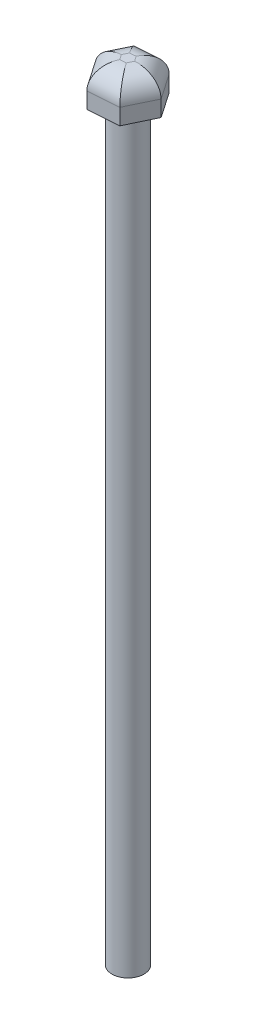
ISO-10303-21;
HEADER;
FILE_DESCRIPTION(('STEP AP214'),'2;1');
FILE_NAME('part.step','',(''),(''),'','','');
FILE_SCHEMA(('AUTOMOTIVE_DESIGN { 1 0 10303 214 1 1 1 1 }'));
ENDSEC;
DATA;
#1=APPLICATION_CONTEXT('core data for automotive mechanical design processes');
#2=APPLICATION_PROTOCOL_DEFINITION('international standard','automotive_design',2000,#1);
#3=PRODUCT_CONTEXT('',#1,'mechanical');
#4=PRODUCT('Part','Part','',(#3));
#5=PRODUCT_RELATED_PRODUCT_CATEGORY('part','',(#4));
#6=PRODUCT_DEFINITION_FORMATION('','',#4);
#7=PRODUCT_DEFINITION_CONTEXT('part definition',#1,'design');
#8=PRODUCT_DEFINITION('design','',#6,#7);
#9=PRODUCT_DEFINITION_SHAPE('','',#8);
#10=(LENGTH_UNIT() NAMED_UNIT(*) SI_UNIT(.MILLI.,.METRE.));
#11=(NAMED_UNIT(*) PLANE_ANGLE_UNIT() SI_UNIT($,.RADIAN.));
#12=(NAMED_UNIT(*) SI_UNIT($,.STERADIAN.) SOLID_ANGLE_UNIT());
#13=UNCERTAINTY_MEASURE_WITH_UNIT(LENGTH_MEASURE(1.E-05),#10,'distance_accuracy_value','');
#14=(GEOMETRIC_REPRESENTATION_CONTEXT(3) GLOBAL_UNCERTAINTY_ASSIGNED_CONTEXT((#13)) GLOBAL_UNIT_ASSIGNED_CONTEXT((#10,
#11,#12)) REPRESENTATION_CONTEXT('',''));
#15=CARTESIAN_POINT('',(0.,0.,0.));
#16=DIRECTION('',(0.,0.,1.));
#17=DIRECTION('',(1.,0.,0.));
#18=AXIS2_PLACEMENT_3D('',#15,#16,#17);
#19=CARTESIAN_POINT('',(0.,70.,0.));
#20=DIRECTION('',(0.,-1.,0.));
#21=DIRECTION('',(0.,0.,-1.));
#22=AXIS2_PLACEMENT_3D('',#19,#20,#21);
#23=CYLINDRICAL_SURFACE('',#22,1.5);
#24=CARTESIAN_POINT('',(0.,70.,0.));
#25=DIRECTION('',(0.,1.,0.));
#26=DIRECTION('',(0.,0.,1.));
#27=AXIS2_PLACEMENT_3D('',#24,#25,#26);
#28=CIRCLE('',#27,1.5);
#29=CARTESIAN_POINT('',(0.,70.,1.5));
#30=VERTEX_POINT('',#29);
#31=EDGE_CURVE('E168',#30,#30,#28,.T.);
#32=ORIENTED_EDGE('',*,*,#31,.F.);
#33=EDGE_LOOP('',(#32));
#34=FACE_BOUND('',#33,.T.);
#35=CARTESIAN_POINT('',(0.,0.,0.));
#36=DIRECTION('',(0.,1.,0.));
#37=DIRECTION('',(0.,0.,1.));
#38=AXIS2_PLACEMENT_3D('',#35,#36,#37);
#39=CIRCLE('',#38,1.5);
#40=CARTESIAN_POINT('',(0.,0.,1.5));
#41=VERTEX_POINT('',#40);
#42=EDGE_CURVE('E119',#41,#41,#39,.T.);
#43=ORIENTED_EDGE('',*,*,#42,.T.);
#44=EDGE_LOOP('',(#43));
#45=FACE_BOUND('',#44,.T.);
#46=ADVANCED_FACE('F39',(#34,#45),#23,.T.);
#47=CARTESIAN_POINT('',(0.,0.,0.));
#48=DIRECTION('',(0.,1.,0.));
#49=DIRECTION('',(0.,0.,1.));
#50=AXIS2_PLACEMENT_3D('',#47,#48,#49);
#51=PLANE('',#50);
#52=ORIENTED_EDGE('',*,*,#42,.F.);
#53=EDGE_LOOP('',(#52));
#54=FACE_BOUND('',#53,.T.);
#55=ADVANCED_FACE('F267',(#54),#51,.F.);
#56=CARTESIAN_POINT('',(-1.62532517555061,73.5,-2.38571821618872));
#57=DIRECTION('',(0.90081606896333,0.,0.43420088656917));
#58=DIRECTION('',(0.43420088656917,0.,-0.90081606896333));
#59=AXIS2_PLACEMENT_3D('',#56,#57,#58);
#60=PLANE('',#59);
#61=DIRECTION('',(0.,-1.,0.));
#62=VECTOR('',#61,1.);
#63=CARTESIAN_POINT('',(-2.87875516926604,73.5,0.214713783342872));
#64=LINE('',#63,#62);
#65=CARTESIAN_POINT('',(-2.87875516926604,71.5,0.214713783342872));
#66=VERTEX_POINT('',#65);
#67=CARTESIAN_POINT('',(-2.87875516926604,70.,0.214713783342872));
#68=VERTEX_POINT('',#67);
#69=EDGE_CURVE('E110',#66,#68,#64,.T.);
#70=ORIENTED_EDGE('',*,*,#69,.F.);
#71=DIRECTION('',(-0.43420088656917,0.,0.90081606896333));
#72=VECTOR('',#71,1.);
#73=CARTESIAN_POINT('',(-1.62532517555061,71.5,-2.38571821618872));
#74=LINE('',#73,#72);
#75=CARTESIAN_POINT('',(-1.62532517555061,71.5,-2.38571821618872));
#76=VERTEX_POINT('',#75);
#77=EDGE_CURVE('E11',#66,#76,#74,.F.);
#78=ORIENTED_EDGE('',*,*,#77,.T.);
#79=DIRECTION('',(0.,-1.,0.));
#80=VECTOR('',#79,1.);
#81=CARTESIAN_POINT('',(-1.62532517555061,73.5,-2.38571821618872));
#82=LINE('',#81,#80);
#83=CARTESIAN_POINT('',(-1.62532517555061,70.,-2.38571821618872));
#84=VERTEX_POINT('',#83);
#85=EDGE_CURVE('E134',#76,#84,#82,.T.);
#86=ORIENTED_EDGE('',*,*,#85,.T.);
#87=DIRECTION('',(-0.43420088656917,0.,0.90081606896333));
#88=VECTOR('',#87,1.);
#89=CARTESIAN_POINT('',(-1.62532517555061,70.,-2.38571821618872));
#90=LINE('',#89,#88);
#91=EDGE_CURVE('E126',#84,#68,#90,.T.);
#92=ORIENTED_EDGE('',*,*,#91,.T.);
#93=EDGE_LOOP('',(#70,#78,#86,#92));
#94=FACE_BOUND('',#93,.T.);
#95=ADVANCED_FACE('F132',(#94),#60,.F.);
#96=CARTESIAN_POINT('',(-2.87875516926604,73.5,0.214713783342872));
#97=DIRECTION('',(0.826437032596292,0.,-0.563029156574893));
#98=DIRECTION('',(-0.563029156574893,0.,-0.826437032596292));
#99=AXIS2_PLACEMENT_3D('',#96,#97,#98);
#100=PLANE('',#99);
#101=DIRECTION('',(0.,-1.,0.));
#102=VECTOR('',#101,1.);
#103=CARTESIAN_POINT('',(-1.25342999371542,73.5,2.6004319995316));
#104=LINE('',#103,#102);
#105=CARTESIAN_POINT('',(-1.25342999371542,71.5,2.6004319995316));
#106=VERTEX_POINT('',#105);
#107=CARTESIAN_POINT('',(-1.25342999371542,70.,2.6004319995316));
#108=VERTEX_POINT('',#107);
#109=EDGE_CURVE('E120',#106,#108,#104,.T.);
#110=ORIENTED_EDGE('',*,*,#109,.F.);
#111=DIRECTION('',(0.563029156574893,0.,0.826437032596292));
#112=VECTOR('',#111,1.);
#113=CARTESIAN_POINT('',(-2.87875516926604,71.5,0.214713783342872));
#114=LINE('',#113,#112);
#115=EDGE_CURVE('E49',#106,#66,#114,.F.);
#116=ORIENTED_EDGE('',*,*,#115,.T.);
#117=ORIENTED_EDGE('',*,*,#69,.T.);
#118=DIRECTION('',(0.563029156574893,0.,0.826437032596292));
#119=VECTOR('',#118,1.);
#120=CARTESIAN_POINT('',(-2.87875516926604,70.,0.214713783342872));
#121=LINE('',#120,#119);
#122=EDGE_CURVE('E113',#68,#108,#121,.T.);
#123=ORIENTED_EDGE('',*,*,#122,.T.);
#124=EDGE_LOOP('',(#110,#116,#117,#123));
#125=FACE_BOUND('',#124,.T.);
#126=ADVANCED_FACE('F112',(#125),#100,.F.);
#127=CARTESIAN_POINT('',(-1.25342999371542,73.5,2.6004319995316));
#128=DIRECTION('',(-0.0743790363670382,0.,-0.997230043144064));
#129=DIRECTION('',(-0.997230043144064,0.,0.0743790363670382));
#130=AXIS2_PLACEMENT_3D('',#127,#128,#129);
#131=PLANE('',#130);
#132=DIRECTION('',(0.,-1.,0.));
#133=VECTOR('',#132,1.);
#134=CARTESIAN_POINT('',(1.62532517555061,73.5,2.38571821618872));
#135=LINE('',#134,#133);
#136=CARTESIAN_POINT('',(1.62532517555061,71.5,2.38571821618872));
#137=VERTEX_POINT('',#136);
#138=CARTESIAN_POINT('',(1.62532517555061,70.,2.38571821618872));
#139=VERTEX_POINT('',#138);
#140=EDGE_CURVE('E163',#137,#139,#135,.T.);
#141=ORIENTED_EDGE('',*,*,#140,.F.);
#142=DIRECTION('',(0.997230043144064,0.,-0.0743790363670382));
#143=VECTOR('',#142,1.);
#144=CARTESIAN_POINT('',(-1.25342999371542,71.5,2.6004319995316));
#145=LINE('',#144,#143);
#146=EDGE_CURVE('E64',#137,#106,#145,.F.);
#147=ORIENTED_EDGE('',*,*,#146,.T.);
#148=ORIENTED_EDGE('',*,*,#109,.T.);
#149=DIRECTION('',(0.997230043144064,0.,-0.0743790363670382));
#150=VECTOR('',#149,1.);
#151=CARTESIAN_POINT('',(-1.25342999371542,70.,2.6004319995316));
#152=LINE('',#151,#150);
#153=EDGE_CURVE('E129',#108,#139,#152,.T.);
#154=ORIENTED_EDGE('',*,*,#153,.T.);
#155=EDGE_LOOP('',(#141,#147,#148,#154));
#156=FACE_BOUND('',#155,.T.);
#157=ADVANCED_FACE('F354',(#156),#131,.F.);
#158=CARTESIAN_POINT('',(1.62532517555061,73.5,2.38571821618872));
#159=DIRECTION('',(-0.90081606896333,0.,-0.43420088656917));
#160=DIRECTION('',(-0.43420088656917,0.,0.90081606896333));
#161=AXIS2_PLACEMENT_3D('',#158,#159,#160);
#162=PLANE('',#161);
#163=DIRECTION('',(0.,-1.,0.));
#164=VECTOR('',#163,1.);
#165=CARTESIAN_POINT('',(2.87875516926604,73.5,-0.214713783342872));
#166=LINE('',#165,#164);
#167=CARTESIAN_POINT('',(2.87875516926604,71.5,-0.214713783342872));
#168=VERTEX_POINT('',#167);
#169=CARTESIAN_POINT('',(2.87875516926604,70.,-0.214713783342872));
#170=VERTEX_POINT('',#169);
#171=EDGE_CURVE('E160',#168,#170,#166,.T.);
#172=ORIENTED_EDGE('',*,*,#171,.F.);
#173=DIRECTION('',(0.43420088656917,0.,-0.90081606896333));
#174=VECTOR('',#173,1.);
#175=CARTESIAN_POINT('',(1.62532517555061,71.5,2.38571821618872));
#176=LINE('',#175,#174);
#177=EDGE_CURVE('E201',#168,#137,#176,.F.);
#178=ORIENTED_EDGE('',*,*,#177,.T.);
#179=ORIENTED_EDGE('',*,*,#140,.T.);
#180=DIRECTION('',(0.43420088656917,0.,-0.90081606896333));
#181=VECTOR('',#180,1.);
#182=CARTESIAN_POINT('',(1.62532517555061,70.,2.38571821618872));
#183=LINE('',#182,#181);
#184=EDGE_CURVE('E144',#139,#170,#183,.T.);
#185=ORIENTED_EDGE('',*,*,#184,.T.);
#186=EDGE_LOOP('',(#172,#178,#179,#185));
#187=FACE_BOUND('',#186,.T.);
#188=ADVANCED_FACE('F256',(#187),#162,.F.);
#189=CARTESIAN_POINT('',(2.87875516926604,73.5,-0.214713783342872));
#190=DIRECTION('',(-0.826437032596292,0.,0.563029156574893));
#191=DIRECTION('',(0.563029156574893,0.,0.826437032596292));
#192=AXIS2_PLACEMENT_3D('',#189,#190,#191);
#193=PLANE('',#192);
#194=DIRECTION('',(0.,-1.,0.));
#195=VECTOR('',#194,1.);
#196=CARTESIAN_POINT('',(1.25342999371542,73.5,-2.60043199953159));
#197=LINE('',#196,#195);
#198=CARTESIAN_POINT('',(1.25342999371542,71.5,-2.60043199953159));
#199=VERTEX_POINT('',#198);
#200=CARTESIAN_POINT('',(1.25342999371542,70.,-2.60043199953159));
#201=VERTEX_POINT('',#200);
#202=EDGE_CURVE('E157',#199,#201,#197,.T.);
#203=ORIENTED_EDGE('',*,*,#202,.F.);
#204=DIRECTION('',(-0.563029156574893,0.,-0.826437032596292));
#205=VECTOR('',#204,1.);
#206=CARTESIAN_POINT('',(2.87875516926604,71.5,-0.214713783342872));
#207=LINE('',#206,#205);
#208=EDGE_CURVE('E198',#199,#168,#207,.F.);
#209=ORIENTED_EDGE('',*,*,#208,.T.);
#210=ORIENTED_EDGE('',*,*,#171,.T.);
#211=DIRECTION('',(-0.563029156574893,0.,-0.826437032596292));
#212=VECTOR('',#211,1.);
#213=CARTESIAN_POINT('',(2.87875516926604,70.,-0.214713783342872));
#214=LINE('',#213,#212);
#215=EDGE_CURVE('E148',#170,#201,#214,.T.);
#216=ORIENTED_EDGE('',*,*,#215,.T.);
#217=EDGE_LOOP('',(#203,#209,#210,#216));
#218=FACE_BOUND('',#217,.T.);
#219=ADVANCED_FACE('F253',(#218),#193,.F.);
#220=CARTESIAN_POINT('',(1.25342999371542,73.5,-2.60043199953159));
#221=DIRECTION('',(0.0743790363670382,0.,0.997230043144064));
#222=DIRECTION('',(0.997230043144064,0.,-0.0743790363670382));
#223=AXIS2_PLACEMENT_3D('',#220,#221,#222);
#224=PLANE('',#223);
#225=ORIENTED_EDGE('',*,*,#85,.F.);
#226=DIRECTION('',(-0.997230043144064,0.,0.0743790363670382));
#227=VECTOR('',#226,1.);
#228=CARTESIAN_POINT('',(1.25342999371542,71.5,-2.60043199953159));
#229=LINE('',#228,#227);
#230=EDGE_CURVE('E194',#76,#199,#229,.F.);
#231=ORIENTED_EDGE('',*,*,#230,.T.);
#232=ORIENTED_EDGE('',*,*,#202,.T.);
#233=DIRECTION('',(-0.997230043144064,0.,0.0743790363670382));
#234=VECTOR('',#233,1.);
#235=CARTESIAN_POINT('',(1.25342999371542,70.,-2.60043199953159));
#236=LINE('',#235,#234);
#237=EDGE_CURVE('E152',#201,#84,#236,.T.);
#238=ORIENTED_EDGE('',*,*,#237,.T.);
#239=EDGE_LOOP('',(#225,#231,#232,#238));
#240=FACE_BOUND('',#239,.T.);
#241=ADVANCED_FACE('F242',(#240),#224,.F.);
#242=CARTESIAN_POINT('',(0.,73.5,0.));
#243=DIRECTION('',(0.,1.,0.));
#244=DIRECTION('',(0.,0.,1.));
#245=AXIS2_PLACEMENT_3D('',#242,#243,#244);
#246=PLANE('',#245);
#247=DIRECTION('',(-0.563029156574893,0.,-0.826437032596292));
#248=VECTOR('',#247,1.);
#249=CARTESIAN_POINT('',(-0.39944407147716,73.5,-1.47437368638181));
#250=LINE('',#249,#248);
#251=CARTESIAN_POINT('',(0.575751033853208,73.5,-0.0429427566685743));
#252=VERTEX_POINT('',#251);
#253=CARTESIAN_POINT('',(0.250685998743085,73.5,-0.520086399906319));
#254=VERTEX_POINT('',#253);
#255=EDGE_CURVE('E187',#252,#254,#250,.T.);
#256=ORIENTED_EDGE('',*,*,#255,.T.);
#257=DIRECTION('',(-0.997230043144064,0.,0.0743790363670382));
#258=VECTOR('',#257,1.);
#259=CARTESIAN_POINT('',(-1.47656710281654,73.5,-0.391258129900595));
#260=LINE('',#259,#258);
#261=CARTESIAN_POINT('',(-0.325065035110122,73.5,-0.477143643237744));
#262=VERTEX_POINT('',#261);
#263=EDGE_CURVE('E190',#254,#262,#260,.T.);
#264=ORIENTED_EDGE('',*,*,#263,.T.);
#265=DIRECTION('',(-0.43420088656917,0.,0.90081606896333));
#266=VECTOR('',#265,1.);
#267=CARTESIAN_POINT('',(-1.07712303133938,73.5,1.08311555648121));
#268=LINE('',#267,#266);
#269=CARTESIAN_POINT('',(-0.575751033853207,73.5,0.0429427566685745));
#270=VERTEX_POINT('',#269);
#271=EDGE_CURVE('E172',#262,#270,#268,.T.);
#272=ORIENTED_EDGE('',*,*,#271,.T.);
#273=DIRECTION('',(0.563029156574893,0.,0.826437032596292));
#274=VECTOR('',#273,1.);
#275=CARTESIAN_POINT('',(0.399444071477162,73.5,1.47437368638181));
#276=LINE('',#275,#274);
#277=CARTESIAN_POINT('',(-0.250685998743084,73.5,0.52008639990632));
#278=VERTEX_POINT('',#277);
#279=EDGE_CURVE('E178',#270,#278,#276,.T.);
#280=ORIENTED_EDGE('',*,*,#279,.T.);
#281=DIRECTION('',(0.997230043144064,0.,-0.0743790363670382));
#282=VECTOR('',#281,1.);
#283=CARTESIAN_POINT('',(1.47656710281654,73.5,0.391258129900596));
#284=LINE('',#283,#282);
#285=CARTESIAN_POINT('',(0.325065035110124,73.5,0.477143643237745));
#286=VERTEX_POINT('',#285);
#287=EDGE_CURVE('E181',#278,#286,#284,.T.);
#288=ORIENTED_EDGE('',*,*,#287,.T.);
#289=DIRECTION('',(0.43420088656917,0.,-0.90081606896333));
#290=VECTOR('',#289,1.);
#291=CARTESIAN_POINT('',(1.07712303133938,73.5,-1.08311555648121));
#292=LINE('',#291,#290);
#293=EDGE_CURVE('E184',#286,#252,#292,.T.);
#294=ORIENTED_EDGE('',*,*,#293,.T.);
#295=EDGE_LOOP('',(#256,#264,#272,#280,#288,#294));
#296=FACE_BOUND('',#295,.T.);
#297=ADVANCED_FACE('F232',(#296),#246,.T.);
#298=CARTESIAN_POINT('',(0.,70.,0.));
#299=DIRECTION('',(0.,1.,0.));
#300=DIRECTION('',(0.,0.,1.));
#301=AXIS2_PLACEMENT_3D('',#298,#299,#300);
#302=PLANE('',#301);
#303=ORIENTED_EDGE('',*,*,#31,.T.);
#304=EDGE_LOOP('',(#303));
#305=FACE_BOUND('',#304,.T.);
#306=ORIENTED_EDGE('',*,*,#91,.F.);
#307=ORIENTED_EDGE('',*,*,#237,.F.);
#308=ORIENTED_EDGE('',*,*,#215,.F.);
#309=ORIENTED_EDGE('',*,*,#184,.F.);
#310=ORIENTED_EDGE('',*,*,#153,.F.);
#311=ORIENTED_EDGE('',*,*,#122,.F.);
#312=EDGE_LOOP('',(#306,#307,#308,#309,#310,#311));
#313=FACE_BOUND('',#312,.T.);
#314=ADVANCED_FACE('F124',(#305,#313),#302,.F.);
#315=CARTESIAN_POINT('',(0.0371895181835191,71.5,0.498615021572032));
#316=DIRECTION('',(-0.997230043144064,0.,0.0743790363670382));
#317=DIRECTION('',(0.0743790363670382,0.,0.997230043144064));
#318=AXIS2_PLACEMENT_3D('',#315,#316,#317);
#319=CYLINDRICAL_SURFACE('',#318,2.);
#320=CARTESIAN_POINT('',(-0.250685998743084,71.5,0.52008639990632));
#321=DIRECTION('',(-0.90081606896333,0.,-0.43420088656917));
#322=DIRECTION('',(0.43420088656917,0.,-0.90081606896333));
#323=AXIS2_PLACEMENT_3D('',#320,#321,#322);
#324=ELLIPSE('',#323,2.3094010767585,2.);
#325=EDGE_CURVE('E140',#106,#278,#324,.T.);
#326=ORIENTED_EDGE('',*,*,#325,.F.);
#327=ORIENTED_EDGE('',*,*,#146,.F.);
#328=CARTESIAN_POINT('',(0.325065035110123,71.5,0.477143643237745));
#329=DIRECTION('',(-0.826437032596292,0.,0.563029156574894));
#330=DIRECTION('',(-0.563029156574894,0.,-0.826437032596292));
#331=AXIS2_PLACEMENT_3D('',#328,#329,#330);
#332=ELLIPSE('',#331,2.3094010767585,2.);
#333=EDGE_CURVE('E43',#286,#137,#332,.F.);
#334=ORIENTED_EDGE('',*,*,#333,.F.);
#335=ORIENTED_EDGE('',*,*,#287,.F.);
#336=EDGE_LOOP('',(#326,#327,#334,#335));
#337=FACE_BOUND('',#336,.T.);
#338=ADVANCED_FACE('F41',(#337),#319,.T.);
#339=CARTESIAN_POINT('',(0.450408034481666,71.5,0.217100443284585));
#340=DIRECTION('',(-0.43420088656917,0.,0.90081606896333));
#341=DIRECTION('',(0.90081606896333,0.,0.43420088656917));
#342=AXIS2_PLACEMENT_3D('',#339,#340,#341);
#343=CYLINDRICAL_SURFACE('',#342,2.);
#344=ORIENTED_EDGE('',*,*,#333,.T.);
#345=ORIENTED_EDGE('',*,*,#177,.F.);
#346=CARTESIAN_POINT('',(0.575751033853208,71.5,-0.0429427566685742));
#347=DIRECTION('',(0.0743790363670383,0.,0.997230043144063));
#348=DIRECTION('',(-0.997230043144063,0.,0.0743790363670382));
#349=AXIS2_PLACEMENT_3D('',#346,#347,#348);
#350=ELLIPSE('',#349,2.3094010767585,2.);
#351=EDGE_CURVE('E218',#252,#168,#350,.F.);
#352=ORIENTED_EDGE('',*,*,#351,.F.);
#353=ORIENTED_EDGE('',*,*,#293,.F.);
#354=EDGE_LOOP('',(#344,#345,#352,#353));
#355=FACE_BOUND('',#354,.T.);
#356=ADVANCED_FACE('F259',(#355),#343,.T.);
#357=CARTESIAN_POINT('',(-0.413218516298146,71.5,0.281514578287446));
#358=DIRECTION('',(-0.563029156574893,0.,-0.826437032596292));
#359=DIRECTION('',(-0.826437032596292,0.,0.563029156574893));
#360=AXIS2_PLACEMENT_3D('',#357,#358,#359);
#361=CYLINDRICAL_SURFACE('',#360,2.);
#362=ORIENTED_EDGE('',*,*,#325,.T.);
#363=ORIENTED_EDGE('',*,*,#279,.F.);
#364=CARTESIAN_POINT('',(-0.575751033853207,71.5,0.0429427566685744));
#365=DIRECTION('',(-0.074379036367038,0.,-0.997230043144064));
#366=DIRECTION('',(0.997230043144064,0.,-0.074379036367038));
#367=AXIS2_PLACEMENT_3D('',#364,#365,#366);
#368=ELLIPSE('',#367,2.3094010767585,2.);
#369=EDGE_CURVE('E214',#66,#270,#368,.T.);
#370=ORIENTED_EDGE('',*,*,#369,.F.);
#371=ORIENTED_EDGE('',*,*,#115,.F.);
#372=EDGE_LOOP('',(#362,#363,#370,#371));
#373=FACE_BOUND('',#372,.T.);
#374=ADVANCED_FACE('F226',(#373),#361,.T.);
#375=CARTESIAN_POINT('',(0.413218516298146,71.5,-0.281514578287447));
#376=DIRECTION('',(0.563029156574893,0.,0.826437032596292));
#377=DIRECTION('',(0.826437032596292,0.,-0.563029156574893));
#378=AXIS2_PLACEMENT_3D('',#375,#376,#377);
#379=CYLINDRICAL_SURFACE('',#378,2.);
#380=ORIENTED_EDGE('',*,*,#351,.T.);
#381=ORIENTED_EDGE('',*,*,#208,.F.);
#382=CARTESIAN_POINT('',(0.250685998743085,71.5,-0.520086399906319));
#383=DIRECTION('',(0.90081606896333,0.,0.43420088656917));
#384=DIRECTION('',(-0.43420088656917,0.,0.90081606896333));
#385=AXIS2_PLACEMENT_3D('',#382,#383,#384);
#386=ELLIPSE('',#385,2.3094010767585,2.);
#387=EDGE_CURVE('E211',#254,#199,#386,.F.);
#388=ORIENTED_EDGE('',*,*,#387,.F.);
#389=ORIENTED_EDGE('',*,*,#255,.F.);
#390=EDGE_LOOP('',(#380,#381,#388,#389));
#391=FACE_BOUND('',#390,.T.);
#392=ADVANCED_FACE('F250',(#391),#379,.T.);
#393=CARTESIAN_POINT('',(-0.450408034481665,71.5,-0.217100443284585));
#394=DIRECTION('',(0.43420088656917,0.,-0.90081606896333));
#395=DIRECTION('',(-0.90081606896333,0.,-0.43420088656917));
#396=AXIS2_PLACEMENT_3D('',#393,#394,#395);
#397=CYLINDRICAL_SURFACE('',#396,2.);
#398=ORIENTED_EDGE('',*,*,#369,.T.);
#399=ORIENTED_EDGE('',*,*,#271,.F.);
#400=CARTESIAN_POINT('',(-0.325065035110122,71.5,-0.477143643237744));
#401=DIRECTION('',(0.826437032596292,0.,-0.563029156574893));
#402=DIRECTION('',(-0.563029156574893,0.,-0.826437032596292));
#403=AXIS2_PLACEMENT_3D('',#400,#401,#402);
#404=ELLIPSE('',#403,2.3094010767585,2.);
#405=EDGE_CURVE('E208',#76,#262,#404,.T.);
#406=ORIENTED_EDGE('',*,*,#405,.F.);
#407=ORIENTED_EDGE('',*,*,#77,.F.);
#408=EDGE_LOOP('',(#398,#399,#406,#407));
#409=FACE_BOUND('',#408,.T.);
#410=ADVANCED_FACE('F238',(#409),#397,.T.);
#411=CARTESIAN_POINT('',(-0.0371895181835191,71.5,-0.498615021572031));
#412=DIRECTION('',(0.997230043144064,0.,-0.0743790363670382));
#413=DIRECTION('',(-0.0743790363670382,0.,-0.997230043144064));
#414=AXIS2_PLACEMENT_3D('',#411,#412,#413);
#415=CYLINDRICAL_SURFACE('',#414,2.);
#416=ORIENTED_EDGE('',*,*,#387,.T.);
#417=ORIENTED_EDGE('',*,*,#230,.F.);
#418=ORIENTED_EDGE('',*,*,#405,.T.);
#419=ORIENTED_EDGE('',*,*,#263,.F.);
#420=EDGE_LOOP('',(#416,#417,#418,#419));
#421=FACE_BOUND('',#420,.T.);
#422=ADVANCED_FACE('F245',(#421),#415,.T.);
#423=CLOSED_SHELL('',(#46,#55,#95,#126,#157,#188,#219,#241,#297,#314,#338,#356,#374,#392,#410,#422));
#424=MANIFOLD_SOLID_BREP('B2',#423);
#425=ADVANCED_BREP_SHAPE_REPRESENTATION('',(#18,#424),#14);
#426=SHAPE_DEFINITION_REPRESENTATION(#9,#425);
ENDSEC;
END-ISO-10303-21;
